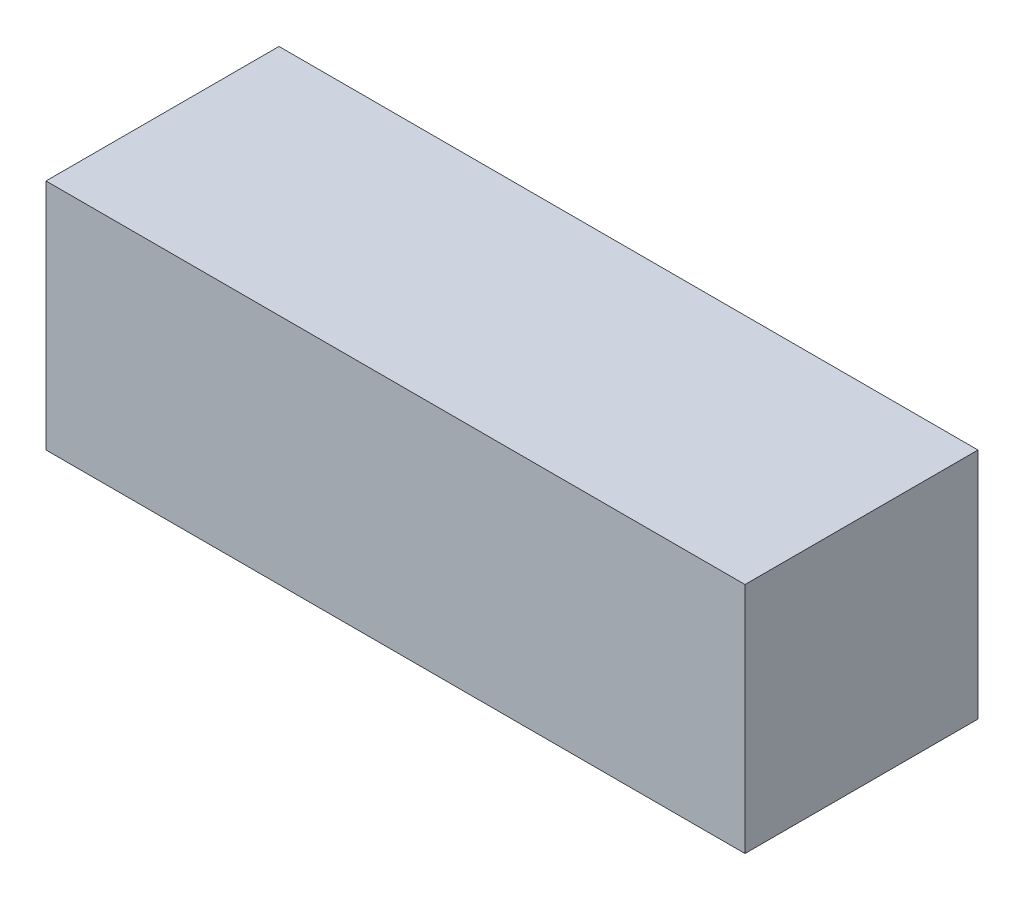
ISO-10303-21;
HEADER;
FILE_DESCRIPTION(('STEP AP214'),'2;1');
FILE_NAME('part.step','',(''),(''),'','','');
FILE_SCHEMA(('AUTOMOTIVE_DESIGN { 1 0 10303 214 1 1 1 1 }'));
ENDSEC;
DATA;
#1=APPLICATION_CONTEXT('core data for automotive mechanical design processes');
#2=APPLICATION_PROTOCOL_DEFINITION('international standard','automotive_design',2000,#1);
#3=PRODUCT_CONTEXT('',#1,'mechanical');
#4=PRODUCT('Part','Part','',(#3));
#5=PRODUCT_RELATED_PRODUCT_CATEGORY('part','',(#4));
#6=PRODUCT_DEFINITION_FORMATION('','',#4);
#7=PRODUCT_DEFINITION_CONTEXT('part definition',#1,'design');
#8=PRODUCT_DEFINITION('design','',#6,#7);
#9=PRODUCT_DEFINITION_SHAPE('','',#8);
#10=(LENGTH_UNIT() NAMED_UNIT(*) SI_UNIT(.MILLI.,.METRE.));
#11=(NAMED_UNIT(*) PLANE_ANGLE_UNIT() SI_UNIT($,.RADIAN.));
#12=(NAMED_UNIT(*) SI_UNIT($,.STERADIAN.) SOLID_ANGLE_UNIT());
#13=UNCERTAINTY_MEASURE_WITH_UNIT(LENGTH_MEASURE(1.E-05),#10,'distance_accuracy_value','');
#14=(GEOMETRIC_REPRESENTATION_CONTEXT(3) GLOBAL_UNCERTAINTY_ASSIGNED_CONTEXT((#13)) GLOBAL_UNIT_ASSIGNED_CONTEXT((#10,
#11,#12)) REPRESENTATION_CONTEXT('',''));
#15=CARTESIAN_POINT('',(0.,0.,0.));
#16=DIRECTION('',(0.,0.,1.));
#17=DIRECTION('',(1.,0.,0.));
#18=AXIS2_PLACEMENT_3D('',#15,#16,#17);
#19=CARTESIAN_POINT('',(0.,25.,0.));
#20=DIRECTION('',(1.,0.,0.));
#21=DIRECTION('',(0.,0.,-1.));
#22=AXIS2_PLACEMENT_3D('',#19,#20,#21);
#23=PLANE('',#22);
#24=DIRECTION('',(0.,0.,1.));
#25=VECTOR('',#24,1.);
#26=CARTESIAN_POINT('',(0.,0.,0.));
#27=LINE('',#26,#25);
#28=CARTESIAN_POINT('',(0.,0.,-25.));
#29=VERTEX_POINT('',#28);
#30=CARTESIAN_POINT('',(0.,0.,0.));
#31=VERTEX_POINT('',#30);
#32=EDGE_CURVE('E76',#29,#31,#27,.T.);
#33=ORIENTED_EDGE('',*,*,#32,.T.);
#34=DIRECTION('',(0.,-1.,0.));
#35=VECTOR('',#34,1.);
#36=CARTESIAN_POINT('',(0.,25.,0.));
#37=LINE('',#36,#35);
#38=CARTESIAN_POINT('',(0.,25.,0.));
#39=VERTEX_POINT('',#38);
#40=EDGE_CURVE('E11',#39,#31,#37,.T.);
#41=ORIENTED_EDGE('',*,*,#40,.F.);
#42=DIRECTION('',(0.,0.,1.));
#43=VECTOR('',#42,1.);
#44=CARTESIAN_POINT('',(0.,25.,0.));
#45=LINE('',#44,#43);
#46=CARTESIAN_POINT('',(0.,25.,-25.));
#47=VERTEX_POINT('',#46);
#48=EDGE_CURVE('E94',#47,#39,#45,.T.);
#49=ORIENTED_EDGE('',*,*,#48,.F.);
#50=DIRECTION('',(0.,-1.,0.));
#51=VECTOR('',#50,1.);
#52=CARTESIAN_POINT('',(0.,25.,-25.));
#53=LINE('',#52,#51);
#54=EDGE_CURVE('E88',#47,#29,#53,.T.);
#55=ORIENTED_EDGE('',*,*,#54,.T.);
#56=EDGE_LOOP('',(#33,#41,#49,#55));
#57=FACE_BOUND('',#56,.T.);
#58=ADVANCED_FACE('F32',(#57),#23,.F.);
#59=CARTESIAN_POINT('',(0.,25.,0.));
#60=DIRECTION('',(0.,0.,-1.));
#61=DIRECTION('',(-1.,0.,0.));
#62=AXIS2_PLACEMENT_3D('',#59,#60,#61);
#63=PLANE('',#62);
#64=DIRECTION('',(1.,0.,0.));
#65=VECTOR('',#64,1.);
#66=CARTESIAN_POINT('',(0.,0.,0.));
#67=LINE('',#66,#65);
#68=CARTESIAN_POINT('',(75.,0.,0.));
#69=VERTEX_POINT('',#68);
#70=EDGE_CURVE('E72',#31,#69,#67,.T.);
#71=ORIENTED_EDGE('',*,*,#70,.T.);
#72=DIRECTION('',(0.,-1.,0.));
#73=VECTOR('',#72,1.);
#74=CARTESIAN_POINT('',(75.,25.,0.));
#75=LINE('',#74,#73);
#76=CARTESIAN_POINT('',(75.,25.,0.));
#77=VERTEX_POINT('',#76);
#78=EDGE_CURVE('E39',#77,#69,#75,.T.);
#79=ORIENTED_EDGE('',*,*,#78,.F.);
#80=DIRECTION('',(1.,0.,0.));
#81=VECTOR('',#80,1.);
#82=CARTESIAN_POINT('',(0.,25.,0.));
#83=LINE('',#82,#81);
#84=EDGE_CURVE('E84',#39,#77,#83,.T.);
#85=ORIENTED_EDGE('',*,*,#84,.F.);
#86=ORIENTED_EDGE('',*,*,#40,.T.);
#87=EDGE_LOOP('',(#71,#79,#85,#86));
#88=FACE_BOUND('',#87,.T.);
#89=ADVANCED_FACE('F83',(#88),#63,.F.);
#90=CARTESIAN_POINT('',(75.,25.,0.));
#91=DIRECTION('',(-1.,0.,0.));
#92=DIRECTION('',(0.,0.,1.));
#93=AXIS2_PLACEMENT_3D('',#90,#91,#92);
#94=PLANE('',#93);
#95=DIRECTION('',(0.,0.,-1.));
#96=VECTOR('',#95,1.);
#97=CARTESIAN_POINT('',(75.,0.,0.));
#98=LINE('',#97,#96);
#99=CARTESIAN_POINT('',(75.,0.,-25.));
#100=VERTEX_POINT('',#99);
#101=EDGE_CURVE('E77',#69,#100,#98,.T.);
#102=ORIENTED_EDGE('',*,*,#101,.T.);
#103=DIRECTION('',(0.,-1.,0.));
#104=VECTOR('',#103,1.);
#105=CARTESIAN_POINT('',(75.,25.,-25.));
#106=LINE('',#105,#104);
#107=CARTESIAN_POINT('',(75.,25.,-25.));
#108=VERTEX_POINT('',#107);
#109=EDGE_CURVE('E100',#108,#100,#106,.T.);
#110=ORIENTED_EDGE('',*,*,#109,.F.);
#111=DIRECTION('',(0.,0.,-1.));
#112=VECTOR('',#111,1.);
#113=CARTESIAN_POINT('',(75.,25.,0.));
#114=LINE('',#113,#112);
#115=EDGE_CURVE('E51',#77,#108,#114,.T.);
#116=ORIENTED_EDGE('',*,*,#115,.F.);
#117=ORIENTED_EDGE('',*,*,#78,.T.);
#118=EDGE_LOOP('',(#102,#110,#116,#117));
#119=FACE_BOUND('',#118,.T.);
#120=ADVANCED_FACE('F103',(#119),#94,.F.);
#121=CARTESIAN_POINT('',(0.,25.,-25.));
#122=DIRECTION('',(0.,0.,1.));
#123=DIRECTION('',(1.,0.,0.));
#124=AXIS2_PLACEMENT_3D('',#121,#122,#123);
#125=PLANE('',#124);
#126=DIRECTION('',(-1.,0.,0.));
#127=VECTOR('',#126,1.);
#128=CARTESIAN_POINT('',(0.,0.,-25.));
#129=LINE('',#128,#127);
#130=EDGE_CURVE('E92',#100,#29,#129,.T.);
#131=ORIENTED_EDGE('',*,*,#130,.T.);
#132=ORIENTED_EDGE('',*,*,#54,.F.);
#133=DIRECTION('',(-1.,0.,0.));
#134=VECTOR('',#133,1.);
#135=CARTESIAN_POINT('',(0.,25.,-25.));
#136=LINE('',#135,#134);
#137=EDGE_CURVE('E46',#108,#47,#136,.T.);
#138=ORIENTED_EDGE('',*,*,#137,.F.);
#139=ORIENTED_EDGE('',*,*,#109,.T.);
#140=EDGE_LOOP('',(#131,#132,#138,#139));
#141=FACE_BOUND('',#140,.T.);
#142=ADVANCED_FACE('F105',(#141),#125,.F.);
#143=CARTESIAN_POINT('',(0.,25.,-25.));
#144=DIRECTION('',(0.,-1.,0.));
#145=DIRECTION('',(0.,0.,-1.));
#146=AXIS2_PLACEMENT_3D('',#143,#144,#145);
#147=PLANE('',#146);
#148=ORIENTED_EDGE('',*,*,#48,.T.);
#149=ORIENTED_EDGE('',*,*,#84,.T.);
#150=ORIENTED_EDGE('',*,*,#115,.T.);
#151=ORIENTED_EDGE('',*,*,#137,.T.);
#152=EDGE_LOOP('',(#148,#149,#150,#151));
#153=FACE_BOUND('',#152,.T.);
#154=ADVANCED_FACE('F106',(#153),#147,.F.);
#155=CARTESIAN_POINT('',(0.,0.,-25.));
#156=DIRECTION('',(0.,-1.,0.));
#157=DIRECTION('',(0.,0.,-1.));
#158=AXIS2_PLACEMENT_3D('',#155,#156,#157);
#159=PLANE('',#158);
#160=ORIENTED_EDGE('',*,*,#32,.F.);
#161=ORIENTED_EDGE('',*,*,#130,.F.);
#162=ORIENTED_EDGE('',*,*,#101,.F.);
#163=ORIENTED_EDGE('',*,*,#70,.F.);
#164=EDGE_LOOP('',(#160,#161,#162,#163));
#165=FACE_BOUND('',#164,.T.);
#166=ADVANCED_FACE('F73',(#165),#159,.T.);
#167=CLOSED_SHELL('',(#58,#89,#120,#142,#154,#166));
#168=MANIFOLD_SOLID_BREP('B2',#167);
#169=ADVANCED_BREP_SHAPE_REPRESENTATION('',(#18,#168),#14);
#170=SHAPE_DEFINITION_REPRESENTATION(#9,#169);
ENDSEC;
END-ISO-10303-21;
